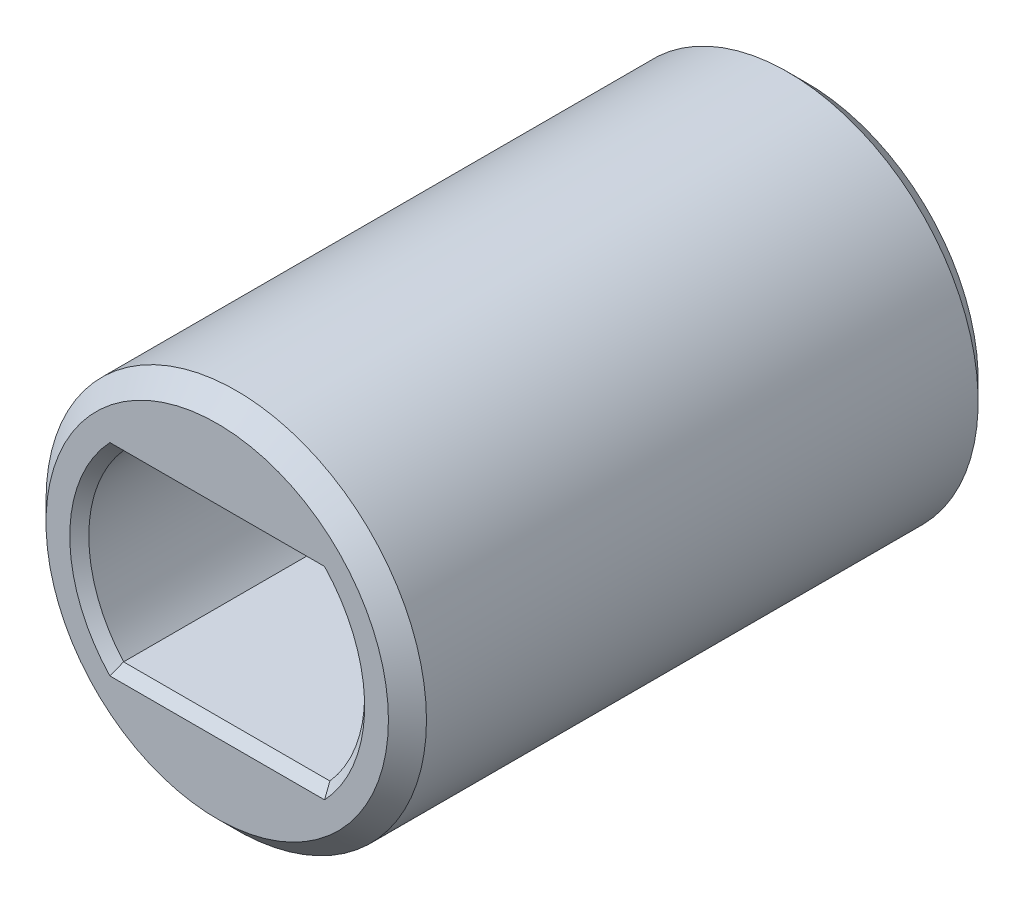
from build123d import *

# Parameters (mm, degrees)
SKICA1_R                 = 4
P_IDAT_VYSUNUT_M1_DEPTH  = 8.4
P_IDAT_START             = 4
SKICA2_R                 = 4
P_IDAT_VYSUNUT_M2_DEPTH  = 4
SKICA3_R                 = 2
ODEBRAT_VYSUNUT_M1_DEPTH = 2
ZKOSEN_2_SIZE            = 0.2
ZKOSEN_3_SIZE            = 0.4


with BuildPart() as part:
    # Skica1 → P_idat vysunut_m1 (new body)
    with BuildSketch(Plane.XY):
        Circle(SKICA1_R)
        with BuildLine():
            Line((-2.168957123, 1.925), (2.168957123, 1.925))
            ThreePointArc((2.168957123, 1.925), (2.9, 0), (2.168957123, -1.925))
            Line((2.168957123, -1.925), (-2.168957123, -1.925))
            ThreePointArc((-2.168957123, -1.925), (-2.9, 0), (-2.168957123, 1.925))
        make_face(mode=Mode.SUBTRACT)
    extrude(amount=P_IDAT_VYSUNUT_M1_DEPTH)

    # Skica2 → P_idat vysunut_m2 (add)
    with BuildSketch(Plane(origin=(0, 0, 0), x_dir=(-1, 0, 0), z_dir=(0, 0, -1)).offset(P_IDAT_START)):
        Circle(SKICA2_R)
    extrude(amount=-P_IDAT_VYSUNUT_M2_DEPTH)

    # Skica3 → Odebrat vysunut_m1 (cut)
    with BuildSketch(Plane(origin=(0, 0, -4), x_dir=(-1, 0, 0), z_dir=(0, 0, -1))):
        Circle(SKICA3_R)
    extrude(amount=-ODEBRAT_VYSUNUT_M1_DEPTH, mode=Mode.SUBTRACT)

    # Zkosen_2
    zkosen_2_edges = [part.edges().sort_by_distance(p)[0] for p in [
        (0, 1.925, 8.4),
        (2, 0, -4),
        (-2.9, 0, 8.4),
        (0, -1.925, 8.4),
        (2.9, 0, 8.4),
    ]]
    chamfer(zkosen_2_edges, length=ZKOSEN_2_SIZE)

    # Zkosen_3
    zkosen_3_edges = [part.edges().sort_by_distance(p)[0] for p in [
        (4, 0, -4),
        (-4, 0, 8.4),
    ]]
    chamfer(zkosen_3_edges, length=ZKOSEN_3_SIZE)


solid = part.part
